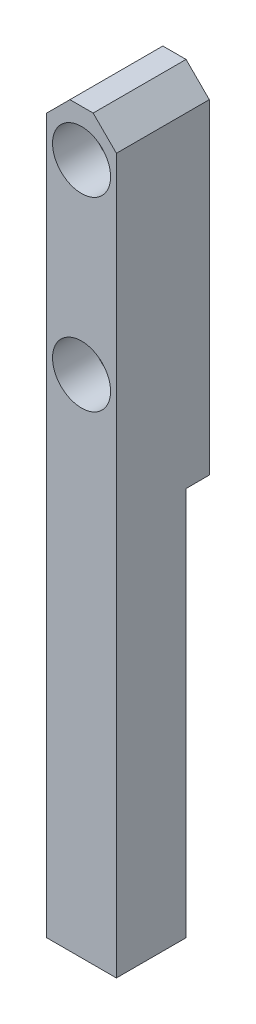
ISO-10303-21;
HEADER;
FILE_DESCRIPTION(('STEP AP214'),'2;1');
FILE_NAME('part.step','',(''),(''),'','','');
FILE_SCHEMA(('AUTOMOTIVE_DESIGN { 1 0 10303 214 1 1 1 1 }'));
ENDSEC;
DATA;
#1=APPLICATION_CONTEXT('core data for automotive mechanical design processes');
#2=APPLICATION_PROTOCOL_DEFINITION('international standard','automotive_design',2000,#1);
#3=PRODUCT_CONTEXT('',#1,'mechanical');
#4=PRODUCT('Part','Part','',(#3));
#5=PRODUCT_RELATED_PRODUCT_CATEGORY('part','',(#4));
#6=PRODUCT_DEFINITION_FORMATION('','',#4);
#7=PRODUCT_DEFINITION_CONTEXT('part definition',#1,'design');
#8=PRODUCT_DEFINITION('design','',#6,#7);
#9=PRODUCT_DEFINITION_SHAPE('','',#8);
#10=(LENGTH_UNIT() NAMED_UNIT(*) SI_UNIT(.MILLI.,.METRE.));
#11=(NAMED_UNIT(*) PLANE_ANGLE_UNIT() SI_UNIT($,.RADIAN.));
#12=(NAMED_UNIT(*) SI_UNIT($,.STERADIAN.) SOLID_ANGLE_UNIT());
#13=UNCERTAINTY_MEASURE_WITH_UNIT(LENGTH_MEASURE(1.E-05),#10,'distance_accuracy_value','');
#14=(GEOMETRIC_REPRESENTATION_CONTEXT(3) GLOBAL_UNCERTAINTY_ASSIGNED_CONTEXT((#13)) GLOBAL_UNIT_ASSIGNED_CONTEXT((#10,
#11,#12)) REPRESENTATION_CONTEXT('',''));
#15=CARTESIAN_POINT('',(0.,0.,0.));
#16=DIRECTION('',(0.,0.,1.));
#17=DIRECTION('',(1.,0.,0.));
#18=AXIS2_PLACEMENT_3D('',#15,#16,#17);
#19=CARTESIAN_POINT('',(-3.,29.75,6.));
#20=DIRECTION('',(0.707106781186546,-0.707106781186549,0.));
#21=DIRECTION('',(0.,0.,-1.));
#22=AXIS2_PLACEMENT_3D('',#19,#20,#21);
#23=PLANE('',#22);
#24=DIRECTION('',(-0.707106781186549,-0.707106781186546,0.));
#25=VECTOR('',#24,1.);
#26=CARTESIAN_POINT('',(-3.,29.75,6.));
#27=LINE('',#26,#25);
#28=CARTESIAN_POINT('',(-1.,31.75,6.));
#29=VERTEX_POINT('',#28);
#30=CARTESIAN_POINT('',(-3.,29.75,6.));
#31=VERTEX_POINT('',#30);
#32=EDGE_CURVE('E136',#29,#31,#27,.T.);
#33=ORIENTED_EDGE('',*,*,#32,.F.);
#34=DIRECTION('',(0.,0.,1.));
#35=VECTOR('',#34,1.);
#36=CARTESIAN_POINT('',(-1.,31.75,6.));
#37=LINE('',#36,#35);
#38=CARTESIAN_POINT('',(-1.,31.75,-2.));
#39=VERTEX_POINT('',#38);
#40=EDGE_CURVE('E107',#39,#29,#37,.T.);
#41=ORIENTED_EDGE('',*,*,#40,.F.);
#42=DIRECTION('',(0.707106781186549,0.707106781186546,0.));
#43=VECTOR('',#42,1.);
#44=CARTESIAN_POINT('',(-3.,29.75,-2.));
#45=LINE('',#44,#43);
#46=CARTESIAN_POINT('',(-3.,29.75,-2.));
#47=VERTEX_POINT('',#46);
#48=EDGE_CURVE('E11',#47,#39,#45,.T.);
#49=ORIENTED_EDGE('',*,*,#48,.F.);
#50=DIRECTION('',(0.,0.,-1.));
#51=VECTOR('',#50,1.);
#52=CARTESIAN_POINT('',(-3.,29.75,6.));
#53=LINE('',#52,#51);
#54=EDGE_CURVE('E104',#31,#47,#53,.T.);
#55=ORIENTED_EDGE('',*,*,#54,.F.);
#56=EDGE_LOOP('',(#33,#41,#49,#55));
#57=FACE_BOUND('',#56,.T.);
#58=ADVANCED_FACE('F17',(#57),#23,.F.);
#59=CARTESIAN_POINT('',(1.00000000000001,31.75,6.));
#60=DIRECTION('',(-0.707106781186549,-0.707106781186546,0.));
#61=DIRECTION('',(-0.707106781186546,0.707106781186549,0.));
#62=AXIS2_PLACEMENT_3D('',#59,#60,#61);
#63=PLANE('',#62);
#64=DIRECTION('',(-0.707106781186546,0.707106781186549,0.));
#65=VECTOR('',#64,1.);
#66=CARTESIAN_POINT('',(1.00000000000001,31.75,6.));
#67=LINE('',#66,#65);
#68=CARTESIAN_POINT('',(3.,29.75,6.));
#69=VERTEX_POINT('',#68);
#70=CARTESIAN_POINT('',(1.00000000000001,31.75,6.));
#71=VERTEX_POINT('',#70);
#72=EDGE_CURVE('E150',#69,#71,#67,.T.);
#73=ORIENTED_EDGE('',*,*,#72,.F.);
#74=DIRECTION('',(0.,0.,1.));
#75=VECTOR('',#74,1.);
#76=CARTESIAN_POINT('',(3.,29.75,6.));
#77=LINE('',#76,#75);
#78=CARTESIAN_POINT('',(3.,29.75,-2.));
#79=VERTEX_POINT('',#78);
#80=EDGE_CURVE('E193',#79,#69,#77,.T.);
#81=ORIENTED_EDGE('',*,*,#80,.F.);
#82=DIRECTION('',(0.707106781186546,-0.707106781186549,0.));
#83=VECTOR('',#82,1.);
#84=CARTESIAN_POINT('',(1.00000000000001,31.75,-2.));
#85=LINE('',#84,#83);
#86=CARTESIAN_POINT('',(1.00000000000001,31.75,-2.));
#87=VERTEX_POINT('',#86);
#88=EDGE_CURVE('E20',#87,#79,#85,.T.);
#89=ORIENTED_EDGE('',*,*,#88,.F.);
#90=DIRECTION('',(0.,0.,-1.));
#91=VECTOR('',#90,1.);
#92=CARTESIAN_POINT('',(1.00000000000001,31.75,6.));
#93=LINE('',#92,#91);
#94=EDGE_CURVE('E171',#71,#87,#93,.T.);
#95=ORIENTED_EDGE('',*,*,#94,.F.);
#96=EDGE_LOOP('',(#73,#81,#89,#95));
#97=FACE_BOUND('',#96,.T.);
#98=ADVANCED_FACE('F265',(#97),#63,.F.);
#99=CARTESIAN_POINT('',(1.45,27.75,2.5));
#100=DIRECTION('',(0.,0.,-1.));
#101=DIRECTION('',(0.,-1.,0.));
#102=AXIS2_PLACEMENT_3D('',#99,#100,#101);
#103=PLANE('',#102);
#104=CARTESIAN_POINT('',(0.,27.75,2.5));
#105=DIRECTION('',(0.,0.,1.));
#106=DIRECTION('',(1.,0.,0.));
#107=AXIS2_PLACEMENT_3D('',#104,#105,#106);
#108=CIRCLE('',#107,1.45);
#109=CARTESIAN_POINT('',(1.45,27.75,2.5));
#110=VERTEX_POINT('',#109);
#111=EDGE_CURVE('E231',#110,#110,#108,.T.);
#112=ORIENTED_EDGE('',*,*,#111,.F.);
#113=EDGE_LOOP('',(#112));
#114=FACE_BOUND('',#113,.T.);
#115=CARTESIAN_POINT('',(0.,27.75,2.5));
#116=DIRECTION('',(0.,0.,1.));
#117=DIRECTION('',(1.,0.,0.));
#118=AXIS2_PLACEMENT_3D('',#115,#116,#117);
#119=CIRCLE('',#118,2.5);
#120=CARTESIAN_POINT('',(2.5,27.75,2.5));
#121=VERTEX_POINT('',#120);
#122=EDGE_CURVE('E221',#121,#121,#119,.T.);
#123=ORIENTED_EDGE('',*,*,#122,.T.);
#124=EDGE_LOOP('',(#123));
#125=FACE_BOUND('',#124,.T.);
#126=ADVANCED_FACE('F269',(#114,#125),#103,.F.);
#127=CARTESIAN_POINT('',(1.45,11.75,2.5));
#128=DIRECTION('',(0.,0.,-1.));
#129=DIRECTION('',(0.,-1.,0.));
#130=AXIS2_PLACEMENT_3D('',#127,#128,#129);
#131=PLANE('',#130);
#132=CARTESIAN_POINT('',(0.,11.75,2.5));
#133=DIRECTION('',(0.,0.,1.));
#134=DIRECTION('',(1.,0.,0.));
#135=AXIS2_PLACEMENT_3D('',#132,#133,#134);
#136=CIRCLE('',#135,1.45);
#137=CARTESIAN_POINT('',(1.45,11.75,2.5));
#138=VERTEX_POINT('',#137);
#139=EDGE_CURVE('E200',#138,#138,#136,.T.);
#140=ORIENTED_EDGE('',*,*,#139,.F.);
#141=EDGE_LOOP('',(#140));
#142=FACE_BOUND('',#141,.T.);
#143=CARTESIAN_POINT('',(0.,11.75,2.5));
#144=DIRECTION('',(0.,0.,1.));
#145=DIRECTION('',(1.,0.,0.));
#146=AXIS2_PLACEMENT_3D('',#143,#144,#145);
#147=CIRCLE('',#146,2.5);
#148=CARTESIAN_POINT('',(2.5,11.75,2.5));
#149=VERTEX_POINT('',#148);
#150=EDGE_CURVE('E212',#149,#149,#147,.T.);
#151=ORIENTED_EDGE('',*,*,#150,.T.);
#152=EDGE_LOOP('',(#151));
#153=FACE_BOUND('',#152,.T.);
#154=ADVANCED_FACE('F275',(#142,#153),#131,.F.);
#155=CARTESIAN_POINT('',(0.,0.,-2.));
#156=DIRECTION('',(0.,0.,1.));
#157=DIRECTION('',(1.,0.,0.));
#158=AXIS2_PLACEMENT_3D('',#155,#156,#157);
#159=PLANE('',#158);
#160=CARTESIAN_POINT('',(0.,11.75,-2.));
#161=DIRECTION('',(0.,0.,1.));
#162=DIRECTION('',(1.,0.,0.));
#163=AXIS2_PLACEMENT_3D('',#160,#161,#162);
#164=CIRCLE('',#163,1.45);
#165=CARTESIAN_POINT('',(1.45,11.75,-2.));
#166=VERTEX_POINT('',#165);
#167=EDGE_CURVE('E204',#166,#166,#164,.T.);
#168=ORIENTED_EDGE('',*,*,#167,.T.);
#169=EDGE_LOOP('',(#168));
#170=FACE_BOUND('',#169,.T.);
#171=CARTESIAN_POINT('',(0.,27.75,-2.));
#172=DIRECTION('',(0.,0.,1.));
#173=DIRECTION('',(1.,0.,0.));
#174=AXIS2_PLACEMENT_3D('',#171,#172,#173);
#175=CIRCLE('',#174,1.45);
#176=CARTESIAN_POINT('',(1.45,27.75,-2.));
#177=VERTEX_POINT('',#176);
#178=EDGE_CURVE('E220',#177,#177,#175,.T.);
#179=ORIENTED_EDGE('',*,*,#178,.T.);
#180=EDGE_LOOP('',(#179));
#181=FACE_BOUND('',#180,.T.);
#182=DIRECTION('',(1.,0.,0.));
#183=VECTOR('',#182,1.);
#184=CARTESIAN_POINT('',(-3.,31.75,-2.));
#185=LINE('',#184,#183);
#186=EDGE_CURVE('E138',#39,#87,#185,.T.);
#187=ORIENTED_EDGE('',*,*,#186,.T.);
#188=ORIENTED_EDGE('',*,*,#88,.T.);
#189=DIRECTION('',(0.,-1.,0.));
#190=VECTOR('',#189,1.);
#191=CARTESIAN_POINT('',(3.,31.75,-2.));
#192=LINE('',#191,#190);
#193=CARTESIAN_POINT('',(3.,1.75,-2.));
#194=VERTEX_POINT('',#193);
#195=EDGE_CURVE('E197',#79,#194,#192,.T.);
#196=ORIENTED_EDGE('',*,*,#195,.T.);
#197=DIRECTION('',(-1.,0.,0.));
#198=VECTOR('',#197,1.);
#199=CARTESIAN_POINT('',(-3.,1.75,-2.));
#200=LINE('',#199,#198);
#201=CARTESIAN_POINT('',(-3.,1.75,-2.));
#202=VERTEX_POINT('',#201);
#203=EDGE_CURVE('E115',#194,#202,#200,.T.);
#204=ORIENTED_EDGE('',*,*,#203,.T.);
#205=DIRECTION('',(0.,1.,0.));
#206=VECTOR('',#205,1.);
#207=CARTESIAN_POINT('',(-3.,31.75,-2.));
#208=LINE('',#207,#206);
#209=EDGE_CURVE('E112',#202,#47,#208,.T.);
#210=ORIENTED_EDGE('',*,*,#209,.T.);
#211=ORIENTED_EDGE('',*,*,#48,.T.);
#212=EDGE_LOOP('',(#187,#188,#196,#204,#210,#211));
#213=FACE_BOUND('',#212,.T.);
#214=ADVANCED_FACE('F113',(#170,#181,#213),#159,.F.);
#215=CARTESIAN_POINT('',(-3.,1.75,-2.));
#216=DIRECTION('',(0.,1.,0.));
#217=DIRECTION('',(1.,0.,0.));
#218=AXIS2_PLACEMENT_3D('',#215,#216,#217);
#219=PLANE('',#218);
#220=DIRECTION('',(-1.,0.,0.));
#221=VECTOR('',#220,1.);
#222=CARTESIAN_POINT('',(-3.,1.75,0.));
#223=LINE('',#222,#221);
#224=CARTESIAN_POINT('',(3.,1.75,0.));
#225=VERTEX_POINT('',#224);
#226=CARTESIAN_POINT('',(-3.,1.75,0.));
#227=VERTEX_POINT('',#226);
#228=EDGE_CURVE('E142',#225,#227,#223,.T.);
#229=ORIENTED_EDGE('',*,*,#228,.T.);
#230=DIRECTION('',(0.,0.,1.));
#231=VECTOR('',#230,1.);
#232=CARTESIAN_POINT('',(-3.,1.75,-2.));
#233=LINE('',#232,#231);
#234=EDGE_CURVE('E120',#202,#227,#233,.T.);
#235=ORIENTED_EDGE('',*,*,#234,.F.);
#236=ORIENTED_EDGE('',*,*,#203,.F.);
#237=DIRECTION('',(0.,0.,1.));
#238=VECTOR('',#237,1.);
#239=CARTESIAN_POINT('',(3.,1.75,-2.));
#240=LINE('',#239,#238);
#241=EDGE_CURVE('E179',#194,#225,#240,.T.);
#242=ORIENTED_EDGE('',*,*,#241,.T.);
#243=EDGE_LOOP('',(#229,#235,#236,#242));
#244=FACE_BOUND('',#243,.T.);
#245=ADVANCED_FACE('F279',(#244),#219,.F.);
#246=CARTESIAN_POINT('',(0.,0.,0.));
#247=DIRECTION('',(0.,0.,-1.));
#248=DIRECTION('',(0.,-1.,0.));
#249=AXIS2_PLACEMENT_3D('',#246,#247,#248);
#250=PLANE('',#249);
#251=ORIENTED_EDGE('',*,*,#228,.F.);
#252=DIRECTION('',(0.,1.,0.));
#253=VECTOR('',#252,1.);
#254=CARTESIAN_POINT('',(3.,-31.75,0.));
#255=LINE('',#254,#253);
#256=CARTESIAN_POINT('',(3.,-31.75,0.));
#257=VERTEX_POINT('',#256);
#258=EDGE_CURVE('E180',#257,#225,#255,.T.);
#259=ORIENTED_EDGE('',*,*,#258,.F.);
#260=DIRECTION('',(1.,0.,0.));
#261=VECTOR('',#260,1.);
#262=CARTESIAN_POINT('',(-3.,-31.75,0.));
#263=LINE('',#262,#261);
#264=CARTESIAN_POINT('',(-3.,-31.75,0.));
#265=VERTEX_POINT('',#264);
#266=EDGE_CURVE('E40',#265,#257,#263,.T.);
#267=ORIENTED_EDGE('',*,*,#266,.F.);
#268=DIRECTION('',(0.,-1.,0.));
#269=VECTOR('',#268,1.);
#270=CARTESIAN_POINT('',(-3.,-31.75,0.));
#271=LINE('',#270,#269);
#272=EDGE_CURVE('E146',#227,#265,#271,.T.);
#273=ORIENTED_EDGE('',*,*,#272,.F.);
#274=EDGE_LOOP('',(#251,#259,#267,#273));
#275=FACE_BOUND('',#274,.T.);
#276=ADVANCED_FACE('F318',(#275),#250,.T.);
#277=CARTESIAN_POINT('',(0.,0.,6.));
#278=DIRECTION('',(0.,0.,-1.));
#279=DIRECTION('',(0.,-1.,0.));
#280=AXIS2_PLACEMENT_3D('',#277,#278,#279);
#281=PLANE('',#280);
#282=CARTESIAN_POINT('',(0.,11.75,6.));
#283=DIRECTION('',(0.,0.,1.));
#284=DIRECTION('',(1.,0.,0.));
#285=AXIS2_PLACEMENT_3D('',#282,#283,#284);
#286=CIRCLE('',#285,2.5);
#287=CARTESIAN_POINT('',(2.5,11.75,6.));
#288=VERTEX_POINT('',#287);
#289=EDGE_CURVE('E207',#288,#288,#286,.T.);
#290=ORIENTED_EDGE('',*,*,#289,.F.);
#291=EDGE_LOOP('',(#290));
#292=FACE_BOUND('',#291,.T.);
#293=CARTESIAN_POINT('',(0.,27.75,6.));
#294=DIRECTION('',(0.,0.,1.));
#295=DIRECTION('',(1.,0.,0.));
#296=AXIS2_PLACEMENT_3D('',#293,#294,#295);
#297=CIRCLE('',#296,2.5);
#298=CARTESIAN_POINT('',(2.5,27.75,6.));
#299=VERTEX_POINT('',#298);
#300=EDGE_CURVE('E216',#299,#299,#297,.T.);
#301=ORIENTED_EDGE('',*,*,#300,.F.);
#302=EDGE_LOOP('',(#301));
#303=FACE_BOUND('',#302,.T.);
#304=DIRECTION('',(0.,1.,0.));
#305=VECTOR('',#304,1.);
#306=CARTESIAN_POINT('',(3.,-31.75,6.));
#307=LINE('',#306,#305);
#308=CARTESIAN_POINT('',(3.,-31.75,6.));
#309=VERTEX_POINT('',#308);
#310=EDGE_CURVE('E190',#309,#69,#307,.T.);
#311=ORIENTED_EDGE('',*,*,#310,.T.);
#312=ORIENTED_EDGE('',*,*,#72,.T.);
#313=DIRECTION('',(-1.,0.,0.));
#314=VECTOR('',#313,1.);
#315=CARTESIAN_POINT('',(-3.,31.75,6.));
#316=LINE('',#315,#314);
#317=EDGE_CURVE('E166',#71,#29,#316,.T.);
#318=ORIENTED_EDGE('',*,*,#317,.T.);
#319=ORIENTED_EDGE('',*,*,#32,.T.);
#320=DIRECTION('',(0.,-1.,0.));
#321=VECTOR('',#320,1.);
#322=CARTESIAN_POINT('',(-3.,-31.75,6.));
#323=LINE('',#322,#321);
#324=CARTESIAN_POINT('',(-3.,-31.75,6.));
#325=VERTEX_POINT('',#324);
#326=EDGE_CURVE('E125',#31,#325,#323,.T.);
#327=ORIENTED_EDGE('',*,*,#326,.T.);
#328=DIRECTION('',(1.,0.,0.));
#329=VECTOR('',#328,1.);
#330=CARTESIAN_POINT('',(-3.,-31.75,6.));
#331=LINE('',#330,#329);
#332=EDGE_CURVE('E147',#325,#309,#331,.T.);
#333=ORIENTED_EDGE('',*,*,#332,.T.);
#334=EDGE_LOOP('',(#311,#312,#318,#319,#327,#333));
#335=FACE_BOUND('',#334,.T.);
#336=ADVANCED_FACE('F164',(#292,#303,#335),#281,.F.);
#337=CARTESIAN_POINT('',(-3.,-31.75,6.));
#338=DIRECTION('',(0.,1.,0.));
#339=DIRECTION('',(1.,0.,0.));
#340=AXIS2_PLACEMENT_3D('',#337,#338,#339);
#341=PLANE('',#340);
#342=CARTESIAN_POINT('',(0.,-31.75,3.));
#343=DIRECTION('',(0.,-1.,0.));
#344=DIRECTION('',(0.,0.,-1.));
#345=AXIS2_PLACEMENT_3D('',#342,#343,#344);
#346=CIRCLE('',#345,1.25);
#347=CARTESIAN_POINT('',(0.,-31.75,1.75));
#348=VERTEX_POINT('',#347);
#349=EDGE_CURVE('E227',#348,#348,#346,.T.);
#350=ORIENTED_EDGE('',*,*,#349,.F.);
#351=EDGE_LOOP('',(#350));
#352=FACE_BOUND('',#351,.T.);
#353=ORIENTED_EDGE('',*,*,#266,.T.);
#354=DIRECTION('',(0.,0.,-1.));
#355=VECTOR('',#354,1.);
#356=CARTESIAN_POINT('',(3.,-31.75,6.));
#357=LINE('',#356,#355);
#358=EDGE_CURVE('E184',#309,#257,#357,.T.);
#359=ORIENTED_EDGE('',*,*,#358,.F.);
#360=ORIENTED_EDGE('',*,*,#332,.F.);
#361=DIRECTION('',(0.,0.,-1.));
#362=VECTOR('',#361,1.);
#363=CARTESIAN_POINT('',(-3.,-31.75,6.));
#364=LINE('',#363,#362);
#365=EDGE_CURVE('E143',#325,#265,#364,.T.);
#366=ORIENTED_EDGE('',*,*,#365,.T.);
#367=EDGE_LOOP('',(#353,#359,#360,#366));
#368=FACE_BOUND('',#367,.T.);
#369=ADVANCED_FACE('F311',(#352,#368),#341,.F.);
#370=CARTESIAN_POINT('',(-3.,-31.75,6.));
#371=DIRECTION('',(1.,0.,0.));
#372=DIRECTION('',(0.,1.,0.));
#373=AXIS2_PLACEMENT_3D('',#370,#371,#372);
#374=PLANE('',#373);
#375=ORIENTED_EDGE('',*,*,#326,.F.);
#376=ORIENTED_EDGE('',*,*,#54,.T.);
#377=ORIENTED_EDGE('',*,*,#209,.F.);
#378=ORIENTED_EDGE('',*,*,#234,.T.);
#379=ORIENTED_EDGE('',*,*,#272,.T.);
#380=ORIENTED_EDGE('',*,*,#365,.F.);
#381=EDGE_LOOP('',(#375,#376,#377,#378,#379,#380));
#382=FACE_BOUND('',#381,.T.);
#383=ADVANCED_FACE('F122',(#382),#374,.F.);
#384=CARTESIAN_POINT('',(-3.,31.75,6.));
#385=DIRECTION('',(0.,-1.,0.));
#386=DIRECTION('',(0.,0.,-1.));
#387=AXIS2_PLACEMENT_3D('',#384,#385,#386);
#388=PLANE('',#387);
#389=ORIENTED_EDGE('',*,*,#317,.F.);
#390=ORIENTED_EDGE('',*,*,#94,.T.);
#391=ORIENTED_EDGE('',*,*,#186,.F.);
#392=ORIENTED_EDGE('',*,*,#40,.T.);
#393=EDGE_LOOP('',(#389,#390,#391,#392));
#394=FACE_BOUND('',#393,.T.);
#395=ADVANCED_FACE('F168',(#394),#388,.F.);
#396=CARTESIAN_POINT('',(3.,-31.75,6.));
#397=DIRECTION('',(-1.,0.,0.));
#398=DIRECTION('',(0.,0.,1.));
#399=AXIS2_PLACEMENT_3D('',#396,#397,#398);
#400=PLANE('',#399);
#401=ORIENTED_EDGE('',*,*,#195,.F.);
#402=ORIENTED_EDGE('',*,*,#80,.T.);
#403=ORIENTED_EDGE('',*,*,#310,.F.);
#404=ORIENTED_EDGE('',*,*,#358,.T.);
#405=ORIENTED_EDGE('',*,*,#258,.T.);
#406=ORIENTED_EDGE('',*,*,#241,.F.);
#407=EDGE_LOOP('',(#401,#402,#403,#404,#405,#406));
#408=FACE_BOUND('',#407,.T.);
#409=ADVANCED_FACE('F304',(#408),#400,.F.);
#410=CARTESIAN_POINT('',(0.,11.75,6.));
#411=DIRECTION('',(0.,0.,1.));
#412=DIRECTION('',(1.,0.,0.));
#413=AXIS2_PLACEMENT_3D('',#410,#411,#412);
#414=CYLINDRICAL_SURFACE('',#413,1.45);
#415=ORIENTED_EDGE('',*,*,#139,.T.);
#416=EDGE_LOOP('',(#415));
#417=FACE_BOUND('',#416,.T.);
#418=ORIENTED_EDGE('',*,*,#167,.F.);
#419=EDGE_LOOP('',(#418));
#420=FACE_BOUND('',#419,.T.);
#421=ADVANCED_FACE('F295',(#417,#420),#414,.F.);
#422=CARTESIAN_POINT('',(0.,11.75,6.));
#423=DIRECTION('',(0.,0.,1.));
#424=DIRECTION('',(1.,0.,0.));
#425=AXIS2_PLACEMENT_3D('',#422,#423,#424);
#426=CYLINDRICAL_SURFACE('',#425,2.5);
#427=ORIENTED_EDGE('',*,*,#289,.T.);
#428=EDGE_LOOP('',(#427));
#429=FACE_BOUND('',#428,.T.);
#430=ORIENTED_EDGE('',*,*,#150,.F.);
#431=EDGE_LOOP('',(#430));
#432=FACE_BOUND('',#431,.T.);
#433=ADVANCED_FACE('F292',(#429,#432),#426,.F.);
#434=CARTESIAN_POINT('',(0.,27.75,6.));
#435=DIRECTION('',(0.,0.,1.));
#436=DIRECTION('',(1.,0.,0.));
#437=AXIS2_PLACEMENT_3D('',#434,#435,#436);
#438=CYLINDRICAL_SURFACE('',#437,1.45);
#439=ORIENTED_EDGE('',*,*,#111,.T.);
#440=EDGE_LOOP('',(#439));
#441=FACE_BOUND('',#440,.T.);
#442=ORIENTED_EDGE('',*,*,#178,.F.);
#443=EDGE_LOOP('',(#442));
#444=FACE_BOUND('',#443,.T.);
#445=ADVANCED_FACE('F294',(#441,#444),#438,.F.);
#446=CARTESIAN_POINT('',(0.,27.75,6.));
#447=DIRECTION('',(0.,0.,1.));
#448=DIRECTION('',(1.,0.,0.));
#449=AXIS2_PLACEMENT_3D('',#446,#447,#448);
#450=CYLINDRICAL_SURFACE('',#449,2.5);
#451=ORIENTED_EDGE('',*,*,#300,.T.);
#452=EDGE_LOOP('',(#451));
#453=FACE_BOUND('',#452,.T.);
#454=ORIENTED_EDGE('',*,*,#122,.F.);
#455=EDGE_LOOP('',(#454));
#456=FACE_BOUND('',#455,.T.);
#457=ADVANCED_FACE('F261',(#453,#456),#450,.F.);
#458=CARTESIAN_POINT('',(0.,-24.25,3.));
#459=DIRECTION('',(0.,-1.,0.));
#460=DIRECTION('',(0.,0.,-1.));
#461=AXIS2_PLACEMENT_3D('',#458,#459,#460);
#462=CONICAL_SURFACE('',#461,1.24999999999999,1.02974425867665);
#463=CARTESIAN_POINT('',(0.,-24.25,3.));
#464=DIRECTION('',(0.,-1.,0.));
#465=DIRECTION('',(0.,0.,-1.));
#466=AXIS2_PLACEMENT_3D('',#463,#464,#465);
#467=CIRCLE('',#466,1.24999999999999);
#468=CARTESIAN_POINT('',(0.,-24.25,1.75000000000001));
#469=VERTEX_POINT('',#468);
#470=EDGE_CURVE('E238',#469,#469,#467,.T.);
#471=ORIENTED_EDGE('',*,*,#470,.T.);
#472=EDGE_LOOP('',(#471));
#473=FACE_BOUND('',#472,.T.);
#474=CARTESIAN_POINT('',(0.,-23.4989242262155,3.));
#475=VERTEX_POINT('',#474);
#476=VERTEX_LOOP('',#475);
#477=FACE_BOUND('',#476,.T.);
#478=ADVANCED_FACE('F250',(#473,#477),#462,.F.);
#479=CARTESIAN_POINT('',(0.,-31.75,3.));
#480=DIRECTION('',(0.,-1.,0.));
#481=DIRECTION('',(0.,0.,-1.));
#482=AXIS2_PLACEMENT_3D('',#479,#480,#481);
#483=CYLINDRICAL_SURFACE('',#482,1.24999999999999);
#484=ORIENTED_EDGE('',*,*,#349,.T.);
#485=EDGE_LOOP('',(#484));
#486=FACE_BOUND('',#485,.T.);
#487=ORIENTED_EDGE('',*,*,#470,.F.);
#488=EDGE_LOOP('',(#487));
#489=FACE_BOUND('',#488,.T.);
#490=ADVANCED_FACE('F253',(#486,#489),#483,.F.);
#491=CLOSED_SHELL('',(#58,#98,#126,#154,#214,#245,#276,#336,#369,#383,#395,#409,#421,#433,#445,
#457,#478,#490));
#492=MANIFOLD_SOLID_BREP('B1',#491);
#493=ADVANCED_BREP_SHAPE_REPRESENTATION('',(#18,#492),#14);
#494=SHAPE_DEFINITION_REPRESENTATION(#9,#493);
ENDSEC;
END-ISO-10303-21;
